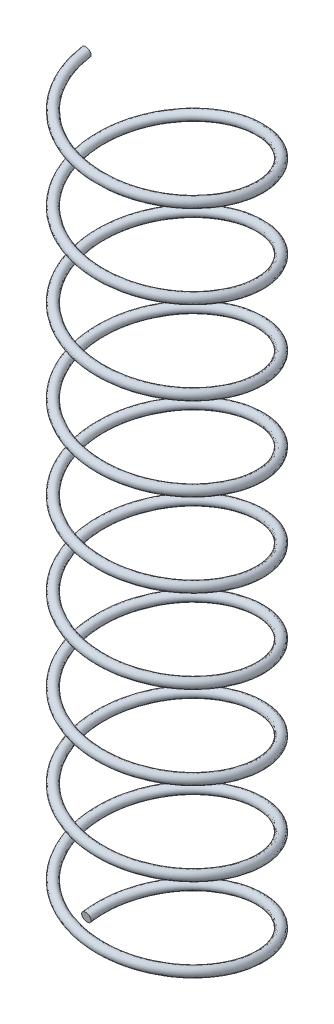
from build123d import *

# Parameters (mm, degrees)
BASE_BALAYAGE_PITCH       = 4.444444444
BASE_BALAYAGE_HEIGHT      = 40
BASE_BALAYAGE_RADIUS      = 4.25
BASE_BALAYAGE_START_ANGLE = -90
ESQUISSE3_R               = 0.25


with BuildPart() as part:
    # Base-Balayage: sweep along a helix
    with BuildLine() as base_balayage_path:
        add(Helix(BASE_BALAYAGE_PITCH, BASE_BALAYAGE_HEIGHT, BASE_BALAYAGE_RADIUS, center=(-1.975900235, 0, 0), direction=(0, 1, 0), lefthand=True, mode=Mode.PRIVATE).rotate(Axis((-1.975900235, 0, 0), (0, 1, 0)), BASE_BALAYAGE_START_ANGLE))
    # Esquisse3 → Base-Balayage (sweep)
    with BuildSketch(Plane(origin=(-6.225900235, 40, 0), x_dir=(-1, 0, 0), z_dir=(1.1297452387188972e-13, 0.16417811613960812, -0.9864307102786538))):
        with Locations((0.054817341, -0.030450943)):
            Circle(ESQUISSE3_R)
    sweep(path=base_balayage_path.line, is_frenet=True)


solid = part.part
